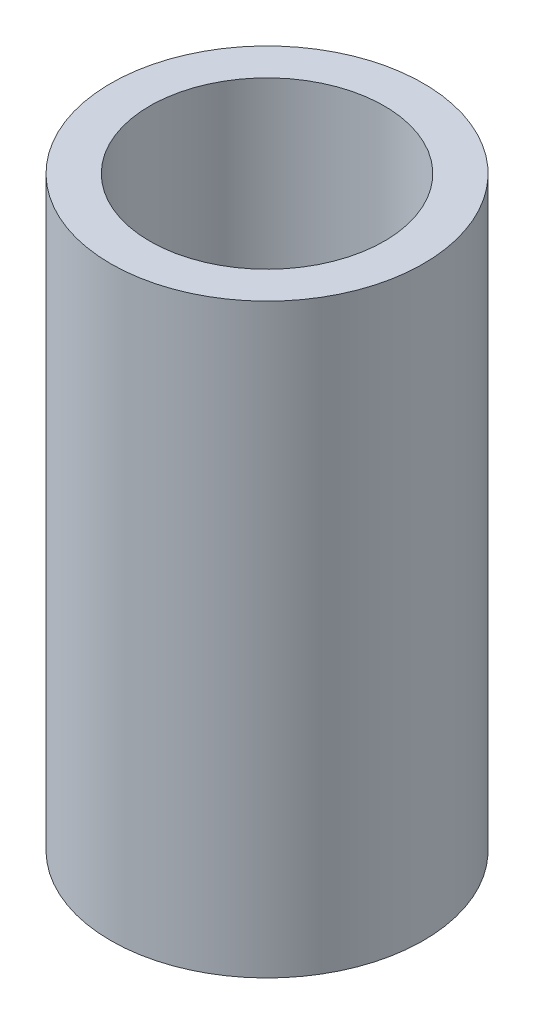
from build123d import *

# Parameters (mm, degrees)
SKETCH1_R           = 2
SKETCH1_R_2         = 1.5
BOSS_EXTRUDE1_DEPTH = 7.5


with BuildPart() as part:
    # Sketch1 → Boss-Extrude1 (new body)
    with BuildSketch(Plane(origin=(0, 0, 0), x_dir=(1, 0, 0), z_dir=(0, 1, 0))):
        with Locations(Location((0, 0, 0), (0, 0, 270))):
            Circle(SKETCH1_R)
        with Locations(Location((0, 0, 0), (0, 0, 270))):
            Circle(SKETCH1_R_2, mode=Mode.SUBTRACT)
    extrude(amount=BOSS_EXTRUDE1_DEPTH)


solid = part.part
